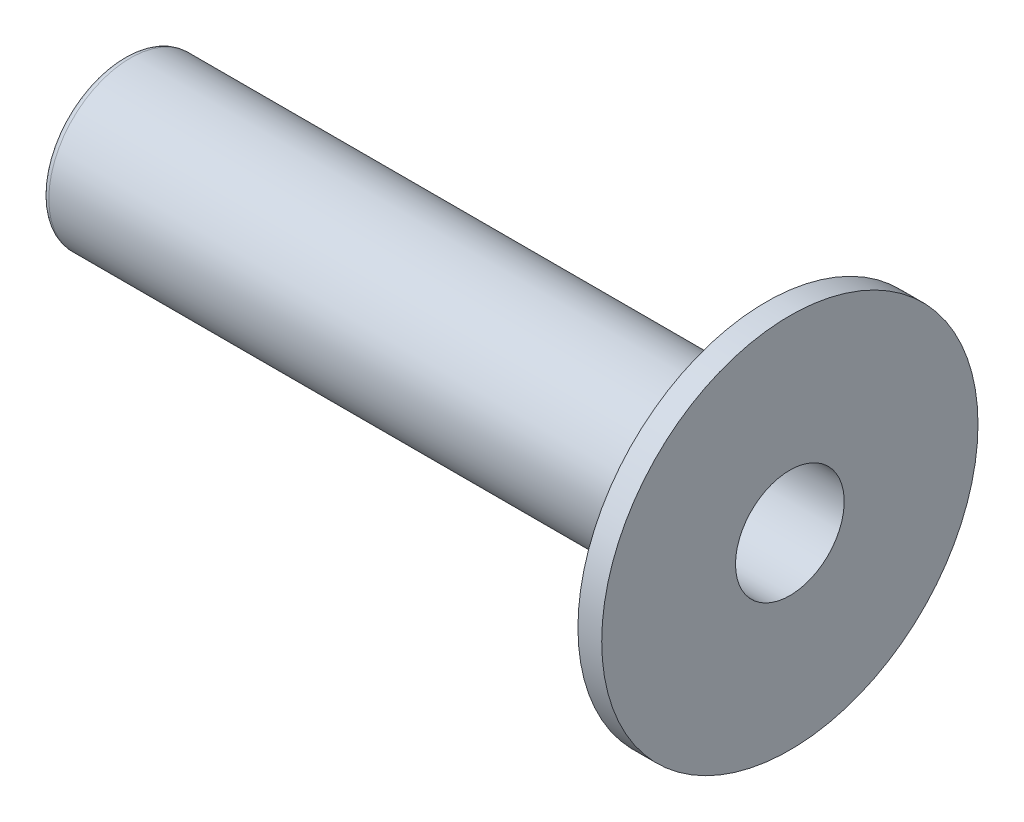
from build123d import *


with BuildPart() as part:
    # Sketch1 → Base-Revolve (revolve)
    with BuildSketch(Plane.XY, mode=Mode.PRIVATE) as base_revolve_sk:
        with BuildLine():
            Line((24.9174, 7.0358), (24.9174, 2.032))
            Line((24.9174, 2.032), (4.7244, 2.032))
            Line((4.7244, 2.032), (4.7244, 1.35255))
            Line((4.7244, 1.35255), (0, 1.35255))
            Line((0, 1.35255), (0, 2.794))
            ThreePointArc((0, 2.794), (0.074394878, 2.973605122), (0.254, 3.048))
            Line((0.254, 3.048), (23.7744, 3.048))
            ThreePointArc((23.7744, 3.048), (23.954005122, 3.122394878), (24.0284, 3.302))
            Line((24.0284, 3.302), (24.0284, 7.0358))
            Line((24.0284, 7.0358), (24.9174, 7.0358))
        make_face()
    revolve(base_revolve_sk.sketch.rotate(Axis((0, 0, 0), (1, 0, 0)), 90), axis=Axis((0, 0, 0), (1, 0, 0)))


solid = part.part
